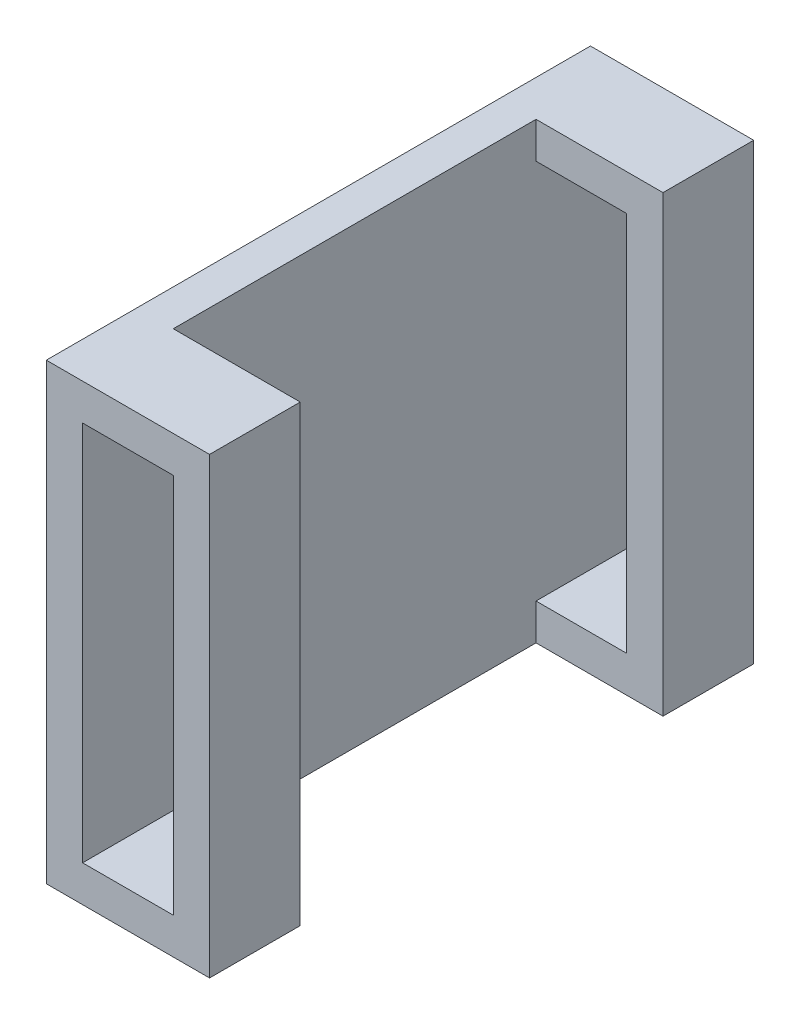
from build123d import *

# Parameters (mm, degrees)
SKETCH1_W           = 30
SKETCH1_H           = 25
BOSS_EXTRUDE1_DEPTH = 2
SKETCH2_W           = 5
SKETCH2_H           = 25
BOSS_EXTRUDE2_DEPTH = 7
SKETCH3_W           = 5
SKETCH3_H           = 25
BOSS_EXTRUDE3_DEPTH = 7
SKETCH4_W           = 5
SKETCH4_H           = 21
CUT_EXTRUDE1_DEPTH  = 41.074929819


with BuildPart() as part:
    # Sketch1 → Boss-Extrude1 (new body)
    with BuildSketch(Plane(origin=(0, 0, 0), x_dir=(0, 0, -1), z_dir=(1, 0, 0))):
        with Locations((15, 12.5)):
            Rectangle(SKETCH1_W, SKETCH1_H)
    extrude(amount=BOSS_EXTRUDE1_DEPTH)

    # Sketch2 → Boss-Extrude2 (add)
    with BuildSketch(Plane(origin=(2, 0, 0), x_dir=(0, 0, -1), z_dir=(1, 0, 0))):
        with Locations((2.5, 12.5)):
            Rectangle(SKETCH2_W, SKETCH2_H)
    extrude(amount=BOSS_EXTRUDE2_DEPTH)

    # Sketch3 → Boss-Extrude3 (add)
    with BuildSketch(Plane(origin=(2, 0, 0), x_dir=(0, 0, -1), z_dir=(1, 0, 0))):
        with Locations((27.5, 12.5)):
            Rectangle(SKETCH3_W, SKETCH3_H)
    extrude(amount=BOSS_EXTRUDE3_DEPTH)

    # Sketch4 → Cut-Extrude1 (cut, through all)
    with BuildSketch(Plane(origin=(0, 0, -30), x_dir=(-1, 0, 0), z_dir=(0, 0, -1))):
        with Locations((-4.5, 12.5)):
            Rectangle(SKETCH4_W, SKETCH4_H)
    extrude(amount=-CUT_EXTRUDE1_DEPTH, mode=Mode.SUBTRACT)


solid = part.part
